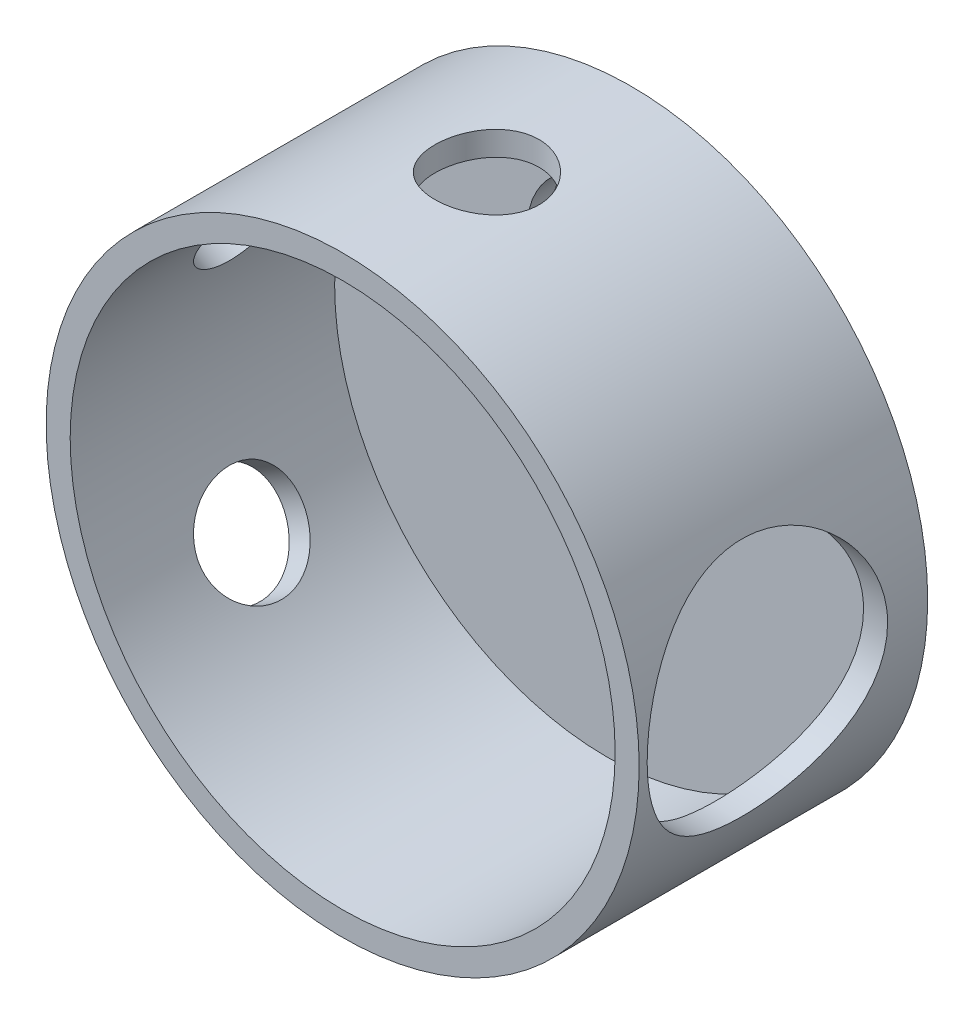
from build123d import *

# Parameters (mm, degrees)
ESQUISSE1_R                  = 37
EXTRUSION1_DEPTH             = 3
ESQUISSE2_R                  = 37
ESQUISSE2_R_2                = 34
EXTRU_MINCE1_DEPTH           = 33
ESQUISSE4_R                  = 15
EXTRUSION2_DEPTH             = 15
TROU_TARAUD_M51_D            = 4.2
TROU_TARAUD_M51_DEPTH        = 14
TROU_TARAUD_M51_TIP          = 1.2618073
ESQUISSE9_R                  = 10
EXTRUSION3_DEPTH             = 10
ESQUISSE10_R                 = 6.5
EXTRUSION4_DEPTH             = 64.513778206
R_P_TITION_CIRCULAIRE1_COUNT = 3
R_P_TITION_CIRCULAIRE1_ANGLE = 120


with BuildPart() as part:
    # Esquisse1 → Extrusion1 (new body)
    with BuildSketch(Plane.XY):
        Circle(ESQUISSE1_R)
    extrude(amount=EXTRUSION1_DEPTH)

    # Esquisse2 → Extru.-Mince1 (add)
    with BuildSketch(Plane.XY.offset(3)):
        Circle(ESQUISSE2_R)
        Circle(ESQUISSE2_R_2, mode=Mode.SUBTRACT)
    extrude(amount=EXTRU_MINCE1_DEPTH)

    # Esquisse4 → Extrusion2 (cut)
    with BuildSketch(Plane(origin=(37, 0, 0), x_dir=(0, 0, -1), z_dir=(1, 0, 0))):
        with Locations((-20, 0)):
            Circle(ESQUISSE4_R)
    extrude(amount=-EXTRUSION2_DEPTH, mode=Mode.SUBTRACT)

    # Trou taraud_ M51
    with Locations(Plane.XY.offset(3)):
        with Locations((0, -17)):
            Hole(TROU_TARAUD_M51_D / 2, depth=TROU_TARAUD_M51_DEPTH)
            with Locations((0, 0, -(TROU_TARAUD_M51_DEPTH + TROU_TARAUD_M51_TIP / 2))):  # 118° drill point
                Cone(0, TROU_TARAUD_M51_D / 2, TROU_TARAUD_M51_TIP, mode=Mode.SUBTRACT)

    # Esquisse9 → Extrusion3 (cut)
    with BuildSketch(Plane(origin=(0, 0, 0), x_dir=(-1, 0, 0), z_dir=(0, 0, -1))):
        with Locations((0, 18)):
            Circle(ESQUISSE9_R)
    extrude(amount=-EXTRUSION3_DEPTH, mode=Mode.SUBTRACT)

    # Esquisse10 → Extrusion4 (cut, through all)
    with BuildSketch(Plane(origin=(0, 0, 0), x_dir=(1, 0, 0), z_dir=(0, 1, 0))):
        with Locations(Location((0, -18, 0), (0, 0, 90))):
            Circle(ESQUISSE10_R)
    extrusion4 = extrude(amount=EXTRUSION4_DEPTH, mode=Mode.SUBTRACT)

    # R_p_tition circulaire1: Extrusion4 ×3 about axis
    r_p_tition_circulaire1_axis = Axis((0, 0, 3), (0, 0, 1))
    for i in range(1, R_P_TITION_CIRCULAIRE1_COUNT):
        add(extrusion4.rotate(r_p_tition_circulaire1_axis, i * R_P_TITION_CIRCULAIRE1_ANGLE / (R_P_TITION_CIRCULAIRE1_COUNT - 1)), mode=Mode.SUBTRACT)


solid = part.part
